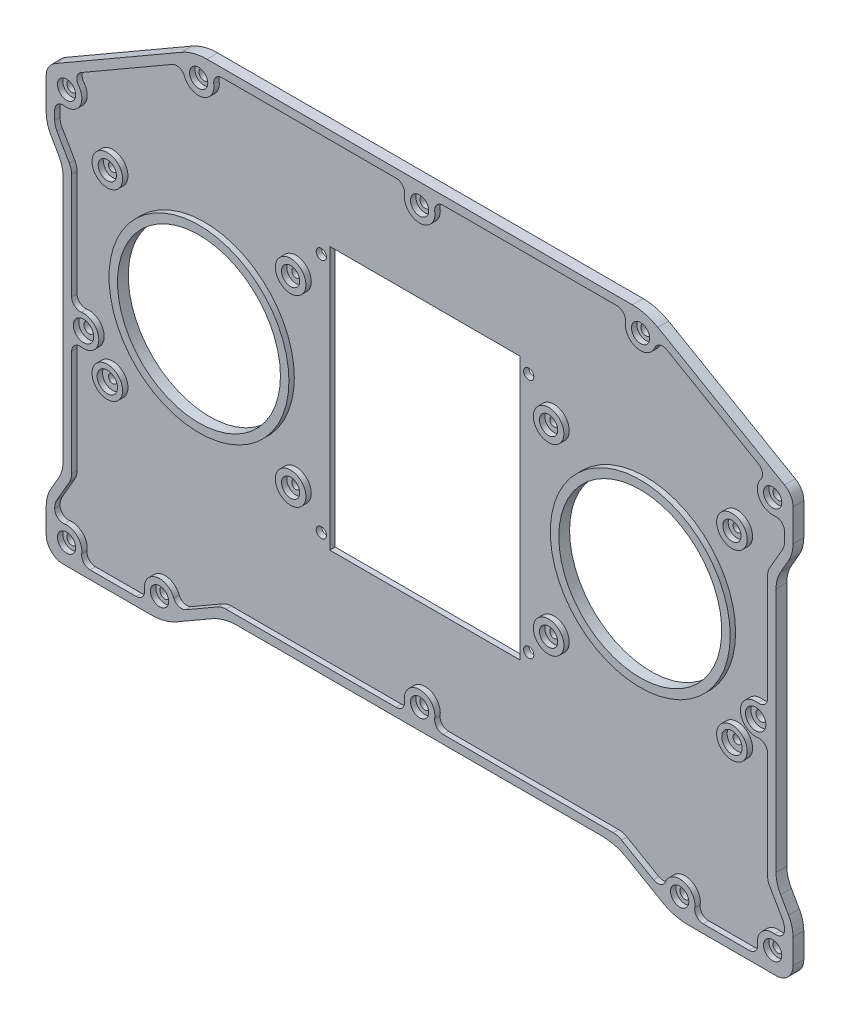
from build123d import *

# Parameters (mm, degrees)
ESQUISSE1_R             = 24
ESQUISSE1_R_2           = 1.25
BOSS_EXTRU_1_DEPTH      = 3.175
ESQUISSE2_R             = 1.5
ENL_V_MAT_EXTRU_1_DEPTH = 3.175
ESQUISSE4_R             = 1.5
ESQUISSE4_W             = 56.1
ESQUISSE4_H             = 77.5
ENL_V_MAT_EXTRU_2_DEPTH = 3.175
ESQUISSE5_R             = 4.5
ESQUISSE5_R_2           = 1.5
ESQUISSE5_R_3           = 26.5
ESQUISSE5_W             = 56.1
ESQUISSE5_H             = 77.5
ESQUISSE5_R_4           = 3
ESQUISSE5_R_5           = 1.25
ESQUISSE5_R_6           = 2.687625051
ENL_V_MAT_EXTRU_3_DEPTH = 1.5875
CONG_1_R                = 2.5


with BuildPart() as part:
    # Esquisse1 → Boss.-Extru.1 (new body)
    with BuildSketch(Plane.XY):
        with BuildLine():
            Line((-107.5, 46.443375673), (-70.179491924, 67.990381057))
            ThreePointArc((-70.179491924, 67.990381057), (-66.561777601, 69.488887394), (-62.679491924, 70))
            Line((-62.679491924, 70), (62.679491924, 70))
            ThreePointArc((62.679491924, 70), (66.561777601, 69.488887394), (70.179491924, 67.990381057))
            Line((70.179491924, 67.990381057), (107.5, 46.443375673))
            ThreePointArc((107.5, 46.443375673), (109.330127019, 44.613248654), (110, 42.113248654))
            Line((110, 42.113248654), (110, 32.679491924))
            ThreePointArc((110, 32.679491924), (109.659258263, 30.091301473), (108.660254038, 27.679491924))
            Line((108.660254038, 27.679491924), (106.339745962, 23.660254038))
            ThreePointArc((106.339745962, 23.660254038), (105.340741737, 21.248444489), (105, 18.660254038))
            Line((105, 18.660254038), (105, -53.660254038))
            ThreePointArc((105, -53.660254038), (105.340741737, -56.248444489), (106.339745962, -58.660254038))
            Line((106.339745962, -58.660254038), (108.660254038, -62.679491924))
            ThreePointArc((108.660254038, -62.679491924), (109.659258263, -65.091301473), (110, -67.679491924))
            Line((110, -67.679491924), (110, -75))
            ThreePointArc((110, -75), (108.535533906, -78.535533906), (105, -80))
            Line((105, -80), (79.019237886, -80))
            ThreePointArc((79.019237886, -80), (75.13695221, -79.488887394), (71.519237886, -77.990381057))
            Line((71.519237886, -77.990381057), (61.160254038, -72.009618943))
            ThreePointArc((61.160254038, -72.009618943), (57.542539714, -70.511112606), (53.660254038, -70))
            Line((53.660254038, -70), (-53.660254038, -70))
            ThreePointArc((-53.660254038, -70), (-57.542539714, -70.511112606), (-61.160254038, -72.009618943))
            Line((-61.160254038, -72.009618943), (-71.519237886, -77.990381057))
            ThreePointArc((-71.519237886, -77.990381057), (-75.13695221, -79.488887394), (-79.019237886, -80))
            Line((-79.019237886, -80), (-105, -80))
            ThreePointArc((-105, -80), (-108.535533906, -78.535533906), (-110, -75))
            Line((-110, -75), (-110, -67.679491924))
            ThreePointArc((-110, -67.679491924), (-109.659258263, -65.091301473), (-108.660254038, -62.679491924))
            Line((-108.660254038, -62.679491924), (-106.339745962, -58.660254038))
            ThreePointArc((-106.339745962, -58.660254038), (-105.340741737, -56.248444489), (-105, -53.660254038))
            Line((-105, -53.660254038), (-105, 18.660254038))
            ThreePointArc((-105, 18.660254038), (-105.340741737, 21.248444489), (-106.339745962, 23.660254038))
            Line((-106.339745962, 23.660254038), (-108.660254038, 27.679491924))
            ThreePointArc((-108.660254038, 27.679491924), (-109.659258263, 30.091301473), (-110, 32.679491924))
            Line((-110, 32.679491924), (-110, 42.113248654))
            ThreePointArc((-110, 42.113248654), (-109.330127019, 44.613248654), (-107.5, 46.443375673))
        make_face()
        with Locations((-65, 0)):
            Circle(ESQUISSE1_R, mode=Mode.SUBTRACT)
        with Locations((-92, 27)):
            Circle(ESQUISSE1_R_2, mode=Mode.SUBTRACT)
        with Locations((-38, 27)):
            Circle(ESQUISSE1_R_2, mode=Mode.SUBTRACT)
        with Locations((-38, -27)):
            Circle(ESQUISSE1_R_2, mode=Mode.SUBTRACT)
        with Locations((-92, -27)):
            Circle(ESQUISSE1_R_2, mode=Mode.SUBTRACT)
        with Locations(Location((92, -27, 0), (0, 0, 180))):
            Circle(ESQUISSE1_R_2, mode=Mode.SUBTRACT)
        with Locations(Location((38, -27, 0), (0, 0, 180))):
            Circle(ESQUISSE1_R_2, mode=Mode.SUBTRACT)
        with Locations(Location((38, 27, 0), (0, 0, 180))):
            Circle(ESQUISSE1_R_2, mode=Mode.SUBTRACT)
        with Locations(Location((92, 27, 0), (0, 0, 180))):
            Circle(ESQUISSE1_R_2, mode=Mode.SUBTRACT)
        with Locations(Location((65, 0, 0), (0, 0, 180))):
            Circle(ESQUISSE1_R, mode=Mode.SUBTRACT)
    extrude(amount=BOSS_EXTRU_1_DEPTH)

    # Esquisse2 → Enl_v. mat.-Extru.1 (cut)
    with BuildSketch(Plane.XY.offset(3.175)):
        with Locations((-104, 41.535898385)):
            Circle(ESQUISSE2_R)
        with Locations((-65.091034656, 64)):
            Circle(ESQUISSE2_R)
        with Locations((0, 64)):
            Circle(ESQUISSE2_R)
        with Locations((0, -64)):
            Circle(ESQUISSE2_R)
        with Locations((-76.607695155, -74)):
            Circle(ESQUISSE2_R)
        with Locations((-104, -74)):
            Circle(ESQUISSE2_R)
        with Locations((-99, -17.5)):
            Circle(ESQUISSE2_R)
        with Locations((99, -17.5)):
            Circle(ESQUISSE2_R)
        with Locations((104, -74)):
            Circle(ESQUISSE2_R)
        with Locations((76.607695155, -74)):
            Circle(ESQUISSE2_R)
        with Locations((65.091034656, 64)):
            Circle(ESQUISSE2_R)
        with Locations((104, 41.535898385)):
            Circle(ESQUISSE2_R)
    extrude(amount=-ENL_V_MAT_EXTRU_1_DEPTH, mode=Mode.SUBTRACT)

    # Esquisse4 → Enl_v. mat.-Extru.2 (cut)
    with BuildSketch(Plane.XY.offset(3.175)):
        with Locations((-30.55, 35.5)):
            Circle(ESQUISSE4_R)
        with Locations((30.55, 35.5)):
            Circle(ESQUISSE4_R)
        with Locations((30.55, -35.5)):
            Circle(ESQUISSE4_R)
        with Locations((-30.55, -35.5)):
            Circle(ESQUISSE4_R)
        Rectangle(ESQUISSE4_W, ESQUISSE4_H)
    extrude(amount=-ENL_V_MAT_EXTRU_2_DEPTH, mode=Mode.SUBTRACT)

    # Esquisse5 → Enl_v. mat.-Extru.3 (cut)
    # profile 1 of 21: a face of its own
    with BuildSketch(Plane.XY.offset(3.175)):
        with BuildLine():
            ThreePointArc((-62.262607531, 67.5), (-63.926348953, 59.653333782), (-69.290524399, 65.616875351))
            Line((-69.290524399, 65.616875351), (-103.300510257, 45.98120086))
            ThreePointArc((-103.300510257, 45.98120086), (-100.102885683, 39.285898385), (-107.5, 38.70747126))
            Line((-107.5, 38.70747126), (-107.5, 32.009618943))
            ThreePointArc((-107.5, 32.009618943), (-107.329629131, 30.715523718), (-106.830127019, 29.509618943))
            Line((-106.830127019, 29.509618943), (-103.169872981, 23.169872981))
            ThreePointArc((-103.169872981, 23.169872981), (-102.670370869, 21.963968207), (-102.5, 20.669872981))
            Line((-102.5, 20.669872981), (-102.5, -14.671572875))
            ThreePointArc((-102.5, -14.671572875), (-94.5, -17.5), (-102.5, -20.328427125))
            Line((-102.5, -20.328427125), (-102.5, -55.669872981))
            ThreePointArc((-102.5, -55.669872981), (-102.670370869, -56.963968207), (-103.169872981, -58.169872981))
            Line((-103.169872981, -58.169872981), (-106.830127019, -64.509618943))
            ThreePointArc((-106.830127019, -64.509618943), (-107.329629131, -65.715523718), (-107.5, -67.009618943))
            Line((-107.5, -67.009618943), (-107.5, -71.171572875))
            ThreePointArc((-107.5, -71.171572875), (-100.818019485, -70.818019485), (-101.171572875, -77.5))
            Line((-101.171572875, -77.5), (-79.436122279, -77.5))
            ThreePointArc((-79.436122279, -77.5), (-77.772380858, -69.653333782), (-72.408205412, -75.616875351))
            Line((-72.408205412, -75.616875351), (-59.509618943, -68.169872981))
            ThreePointArc((-59.509618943, -68.169872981), (-58.303714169, -67.670370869), (-57.009618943, -67.5))
            Line((-57.009618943, -67.5), (-2.828427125, -67.5))
            ThreePointArc((-2.828427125, -67.5), (0, -59.5), (2.828427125, -67.5))
            Line((2.828427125, -67.5), (57.009618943, -67.5))
            ThreePointArc((57.009618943, -67.5), (58.303714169, -67.670370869), (59.509618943, -68.169872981))
            Line((59.509618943, -68.169872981), (72.408205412, -75.616875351))
            ThreePointArc((72.408205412, -75.616875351), (77.772380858, -69.653333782), (79.436122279, -77.5))
            Line((79.436122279, -77.5), (101.171572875, -77.5))
            ThreePointArc((101.171572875, -77.5), (100.818019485, -70.818019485), (107.5, -71.171572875))
            Line((107.5, -71.171572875), (107.5, -67.009618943))
            ThreePointArc((107.5, -67.009618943), (107.329629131, -65.715523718), (106.830127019, -64.509618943))
            Line((106.830127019, -64.509618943), (103.169872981, -58.169872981))
            ThreePointArc((103.169872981, -58.169872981), (102.670370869, -56.963968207), (102.5, -55.669872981))
            Line((102.5, -55.669872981), (102.5, -20.328427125))
            ThreePointArc((102.5, -20.328427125), (94.5, -17.5), (102.5, -14.671572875))
            Line((102.5, -14.671572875), (102.5, 20.669872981))
            ThreePointArc((102.5, 20.669872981), (102.670370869, 21.963968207), (103.169872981, 23.169872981))
            Line((103.169872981, 23.169872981), (106.830127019, 29.509618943))
            ThreePointArc((106.830127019, 29.509618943), (107.329629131, 30.715523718), (107.5, 32.009618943))
            Line((107.5, 32.009618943), (107.5, 38.70747126))
            ThreePointArc((107.5, 38.70747126), (100.102885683, 39.285898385), (103.300510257, 45.98120086))
            Line((103.300510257, 45.98120086), (69.290524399, 65.616875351))
            ThreePointArc((69.290524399, 65.616875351), (63.926348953, 59.653333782), (62.262607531, 67.5))
            Line((62.262607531, 67.5), (2.828427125, 67.5))
            ThreePointArc((2.828427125, 67.5), (0, 59.5), (-2.828427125, 67.5))
            Line((-2.828427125, 67.5), (-62.262607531, 67.5))
        make_face()
        with Locations((-92, -27)):
            Circle(ESQUISSE5_R, mode=Mode.SUBTRACT)
        with Locations((-30.55, -35.5)):
            Circle(ESQUISSE5_R_2, mode=Mode.SUBTRACT)
        with Locations((-38, -27)):
            Circle(ESQUISSE5_R, mode=Mode.SUBTRACT)
        with Locations((30.55, -35.5)):
            Circle(ESQUISSE5_R_2, mode=Mode.SUBTRACT)
        with Locations((38, -27)):
            Circle(ESQUISSE5_R, mode=Mode.SUBTRACT)
        with Locations((92, -27)):
            Circle(ESQUISSE5_R, mode=Mode.SUBTRACT)
        with Locations((-65, 0)):
            Circle(ESQUISSE5_R_3, mode=Mode.SUBTRACT)
        with Locations((-92, 27)):
            Circle(ESQUISSE5_R, mode=Mode.SUBTRACT)
        with Locations((-38, 27)):
            Circle(ESQUISSE5_R, mode=Mode.SUBTRACT)
        with Locations((-30.55, 35.5)):
            Circle(ESQUISSE5_R_2, mode=Mode.SUBTRACT)
        Rectangle(ESQUISSE5_W, ESQUISSE5_H, mode=Mode.SUBTRACT)
        with Locations((38, 27)):
            Circle(ESQUISSE5_R, mode=Mode.SUBTRACT)
        with Locations((65, 0)):
            Circle(ESQUISSE5_R_3, mode=Mode.SUBTRACT)
        with Locations((92, 27)):
            Circle(ESQUISSE5_R, mode=Mode.SUBTRACT)
        with Locations((30.55, 35.5)):
            Circle(ESQUISSE5_R_2, mode=Mode.SUBTRACT)
    # profile 2 of 21: a face of its own
    with BuildSketch(Plane.XY.offset(3.175)):
        with Locations((-92, -27)):
            Circle(ESQUISSE5_R_4)
        with Locations((-92, -27)):
            Circle(ESQUISSE5_R_5, mode=Mode.SUBTRACT)
    # profile 3 of 21: a face of its own
    with BuildSketch(Plane.XY.offset(3.175)):
        with Locations((-104, 41.535898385)):
            Circle(ESQUISSE5_R_6)
        with Locations((-104, 41.535898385)):
            Circle(ESQUISSE5_R_2, mode=Mode.SUBTRACT)
    # profile 4 of 21: a face of its own
    with BuildSketch(Plane.XY.offset(3.175)):
        with Locations((-92, 27)):
            Circle(ESQUISSE5_R_6)
        with Locations((-92, 27)):
            Circle(ESQUISSE5_R_5, mode=Mode.SUBTRACT)
    # profile 5 of 21: a face of its own
    with BuildSketch(Plane.XY.offset(3.175)):
        with Locations((-38, 27)):
            Circle(ESQUISSE5_R_6)
        with Locations((-38, 27)):
            Circle(ESQUISSE5_R_5, mode=Mode.SUBTRACT)
    # profile 6 of 21: a face of its own
    with BuildSketch(Plane.XY.offset(3.175)):
        with Locations((-38, -27)):
            Circle(ESQUISSE5_R_6)
        with Locations((-38, -27)):
            Circle(ESQUISSE5_R_5, mode=Mode.SUBTRACT)
    # profile 7 of 21: a face of its own
    with BuildSketch(Plane.XY.offset(3.175)):
        with Locations((-104, -74)):
            Circle(ESQUISSE5_R_6)
        with Locations((-104, -74)):
            Circle(ESQUISSE5_R_2, mode=Mode.SUBTRACT)
    # profile 8 of 21: a face of its own
    with BuildSketch(Plane.XY.offset(3.175)):
        with Locations((-76.607695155, -74)):
            Circle(ESQUISSE5_R_6)
        with Locations((-76.607695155, -74)):
            Circle(ESQUISSE5_R_2, mode=Mode.SUBTRACT)
    # profile 9 of 21: a face of its own
    with BuildSketch(Plane.XY.offset(3.175)):
        with Locations((0, -64)):
            Circle(ESQUISSE5_R_6)
        with Locations((0, -64)):
            Circle(ESQUISSE5_R_2, mode=Mode.SUBTRACT)
    # profile 10 of 21: a face of its own
    with BuildSketch(Plane.XY.offset(3.175)):
        with Locations((-65.091034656, 64)):
            Circle(ESQUISSE5_R_6)
        with Locations((-65.091034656, 64)):
            Circle(ESQUISSE5_R_2, mode=Mode.SUBTRACT)
    # profile 11 of 21: a face of its own
    with BuildSketch(Plane.XY.offset(3.175)):
        with Locations((0, 64)):
            Circle(ESQUISSE5_R_6)
        with Locations((0, 64)):
            Circle(ESQUISSE5_R_2, mode=Mode.SUBTRACT)
    # profile 12 of 21: a face of its own
    with BuildSketch(Plane.XY.offset(3.175)):
        with Locations((65.091034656, 64)):
            Circle(ESQUISSE5_R_6)
        with Locations((65.091034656, 64)):
            Circle(ESQUISSE5_R_2, mode=Mode.SUBTRACT)
    # profile 13 of 21: a face of its own
    with BuildSketch(Plane.XY.offset(3.175)):
        with Locations((76.607695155, -74)):
            Circle(ESQUISSE5_R_6)
        with Locations((76.607695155, -74)):
            Circle(ESQUISSE5_R_2, mode=Mode.SUBTRACT)
    # profile 14 of 21: a face of its own
    with BuildSketch(Plane.XY.offset(3.175)):
        with Locations((104, -74)):
            Circle(ESQUISSE5_R_6)
        with Locations((104, -74)):
            Circle(ESQUISSE5_R_2, mode=Mode.SUBTRACT)
    # profile 15 of 21: a face of its own
    with BuildSketch(Plane.XY.offset(3.175)):
        with Locations((38, -27)):
            Circle(ESQUISSE5_R_6)
        with Locations(Location((38, -27, 0), (0, 0, 180))):
            Circle(ESQUISSE5_R_5, mode=Mode.SUBTRACT)
    # profile 16 of 21: a face of its own
    with BuildSketch(Plane.XY.offset(3.175)):
        with Locations((38, 27)):
            Circle(ESQUISSE5_R_6)
        with Locations(Location((38, 27, 0), (0, 0, 180))):
            Circle(ESQUISSE5_R_5, mode=Mode.SUBTRACT)
    # profile 17 of 21: a face of its own
    with BuildSketch(Plane.XY.offset(3.175)):
        with Locations((92, 27)):
            Circle(ESQUISSE5_R_6)
        with Locations(Location((92, 27, 0), (0, 0, 180))):
            Circle(ESQUISSE5_R_5, mode=Mode.SUBTRACT)
    # profile 18 of 21: a face of its own
    with BuildSketch(Plane.XY.offset(3.175)):
        with Locations((104, 41.535898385)):
            Circle(ESQUISSE5_R_6)
        with Locations((104, 41.535898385)):
            Circle(ESQUISSE5_R_2, mode=Mode.SUBTRACT)
    # profile 19 of 21: a face of its own
    with BuildSketch(Plane.XY.offset(3.175)):
        with Locations((92, -27)):
            Circle(ESQUISSE5_R_4)
        with Locations(Location((92, -27, 0), (0, 0, 180))):
            Circle(ESQUISSE5_R_5, mode=Mode.SUBTRACT)
    # profile 20 of 21: a face of its own
    with BuildSketch(Plane.XY.offset(3.175)):
        with Locations((-99, -17.5)):
            Circle(ESQUISSE5_R_4)
        with Locations((-99, -17.5)):
            Circle(ESQUISSE5_R_2, mode=Mode.SUBTRACT)
    # profile 21 of 21: a face of its own
    with BuildSketch(Plane.XY.offset(3.175)):
        with Locations((99, -17.5)):
            Circle(ESQUISSE5_R_4)
        with Locations((99, -17.5)):
            Circle(ESQUISSE5_R_2, mode=Mode.SUBTRACT)
    extrude(amount=-ENL_V_MAT_EXTRU_3_DEPTH, mode=Mode.SUBTRACT)

    # Cong_1
    cong_1_edges = [part.edges().sort_by_distance(p)[0] for p in [
        (102.5, -20.328427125, 2.38125),
        (107.5, -71.171572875, 2.38125),
        (101.171572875, -77.5, 2.38125),
        (79.436122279, -77.5, 2.38125),
        (72.408205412, -75.616875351, 2.38125),
        (2.828427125, -67.5, 2.38125),
        (-2.828427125, -67.5, 2.38125),
        (-72.408205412, -75.616875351, 2.38125),
        (-79.436122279, -77.5, 2.38125),
        (-101.171572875, -77.5, 2.38125),
        (-107.5, -71.171572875, 2.38125),
        (-102.5, -20.328427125, 2.38125),
        (-102.5, -14.671572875, 2.38125),
        (-107.5, 38.70747126, 2.38125),
        (-103.300510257, 45.98120086, 2.38125),
        (-69.290524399, 65.616875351, 2.38125),
        (-62.262607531, 67.5, 2.38125),
        (-2.828427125, 67.5, 2.38125),
        (2.828427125, 67.5, 2.38125),
        (62.262607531, 67.5, 2.38125),
        (69.290524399, 65.616875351, 2.38125),
        (103.300510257, 45.98120086, 2.38125),
        (107.5, 38.70747126, 2.38125),
        (102.5, -14.671572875, 2.38125),
    ]]
    fillet(cong_1_edges, radius=CONG_1_R)


solid = part.part
